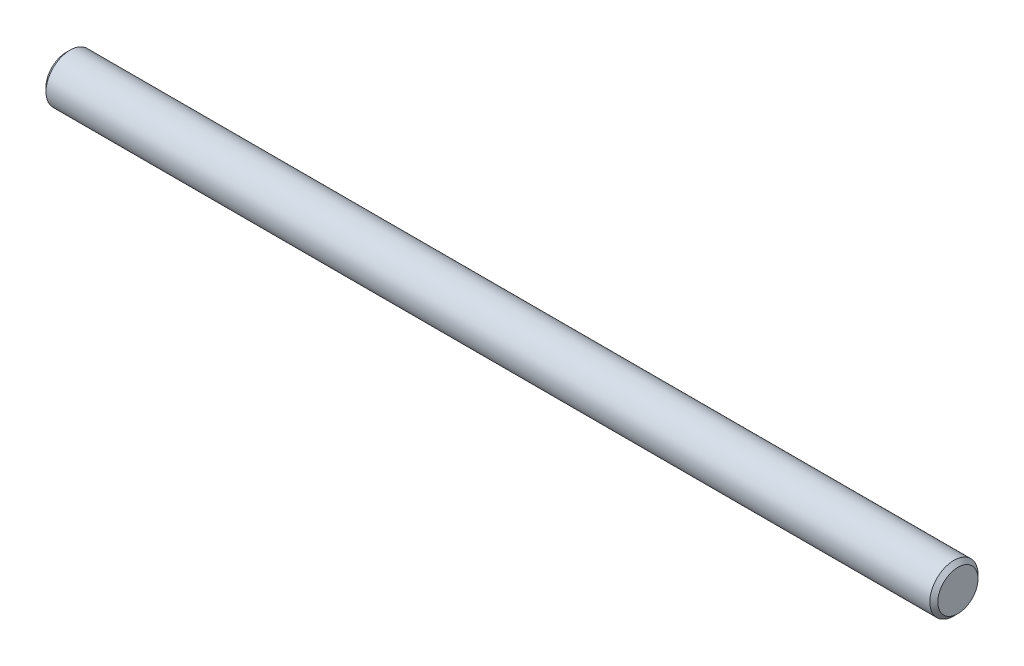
from build123d import *

# Parameters (mm, degrees)
SKETCH1_R      = 6
EXTRUDE1_DEPTH = 222
CHAMFER1_SIZE  = 1


with BuildPart() as part:
    # Sketch1 → Extrude1 (new body)
    with BuildSketch(Plane(origin=(0, 0, 0), x_dir=(0, 0, -1), z_dir=(1, 0, 0))):
        Circle(SKETCH1_R)
    extrude(amount=EXTRUDE1_DEPTH)

    # Chamfer1
    chamfer1_edges = [part.edges().sort_by_distance(p)[0] for p in [
        (0, 0, 6),
        (222, 0, 6),
    ]]
    chamfer(chamfer1_edges, length=CHAMFER1_SIZE)


solid = part.part
